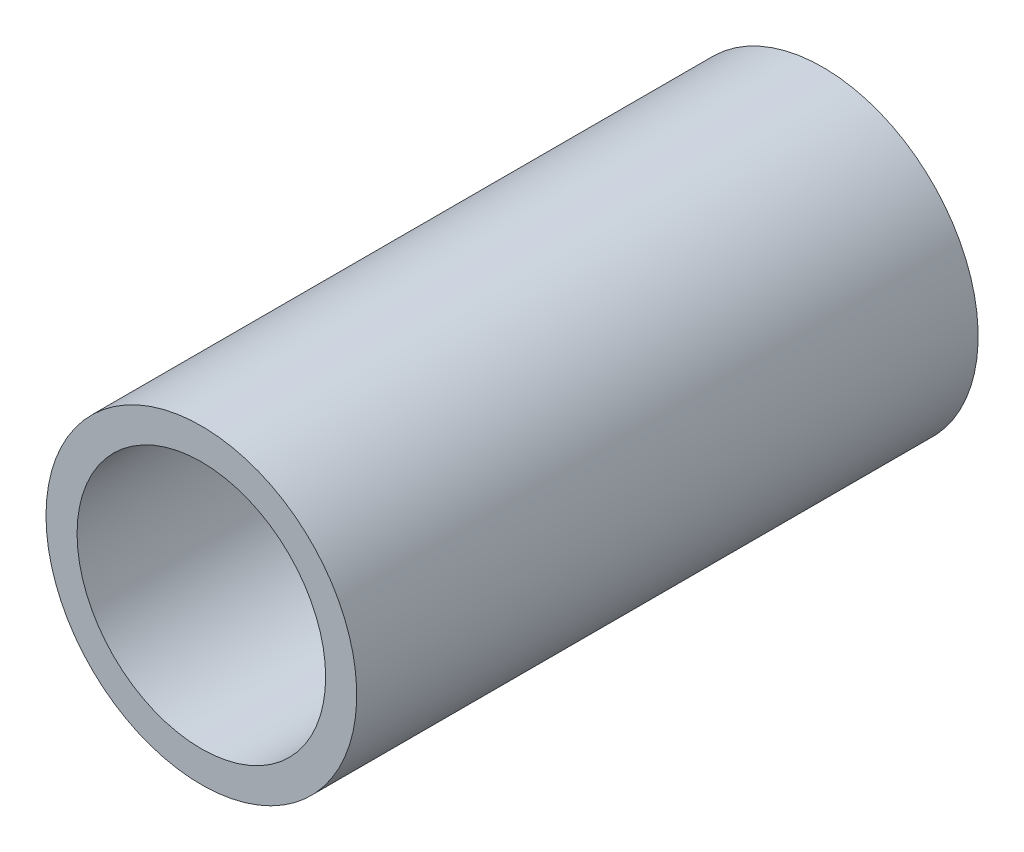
from build123d import *

# Parameters (mm, degrees)
ESQUISSE1_R      = 50
ESQUISSE1_R_2    = 40
EXTRUSION1_DEPTH = 200


with BuildPart() as part:
    # Esquisse1 → Extrusion1 (new body)
    with BuildSketch(Plane.XY):
        Circle(ESQUISSE1_R)
        Circle(ESQUISSE1_R_2, mode=Mode.SUBTRACT)
    extrude(amount=EXTRUSION1_DEPTH)


solid = part.part
